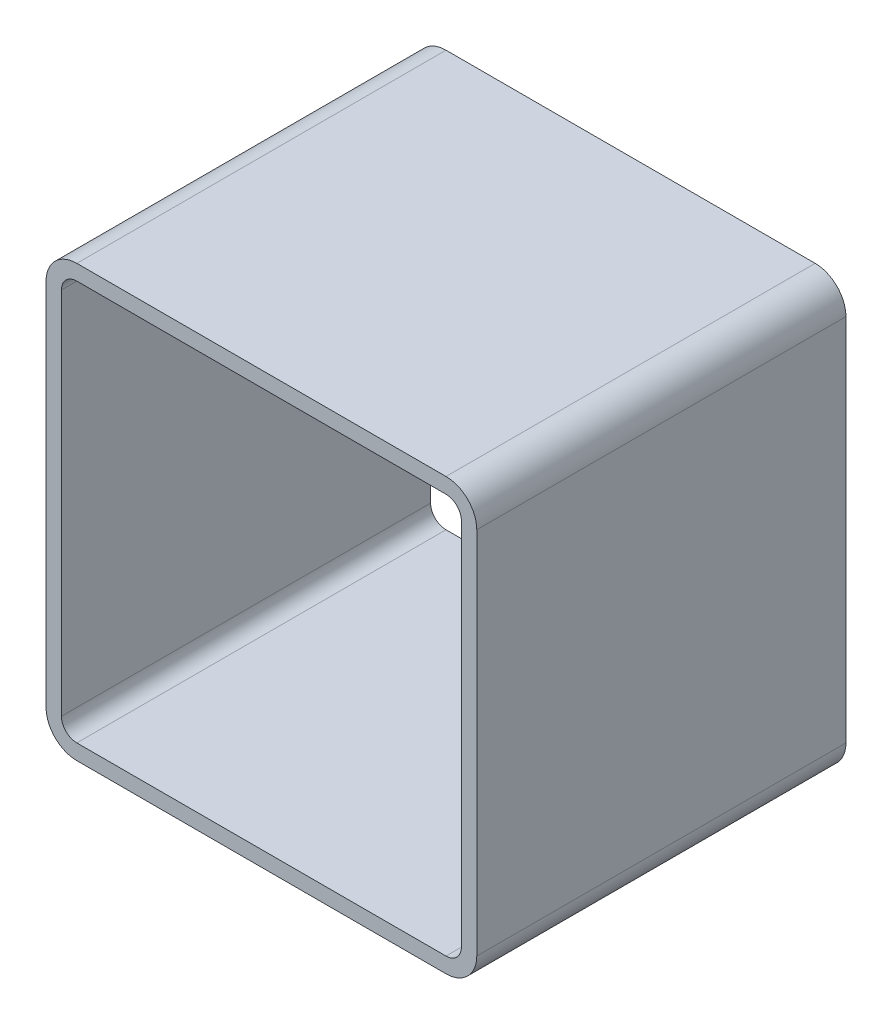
ISO-10303-21;
HEADER;
FILE_DESCRIPTION(('STEP AP214'),'2;1');
FILE_NAME('part.step','',(''),(''),'','','');
FILE_SCHEMA(('AUTOMOTIVE_DESIGN { 1 0 10303 214 1 1 1 1 }'));
ENDSEC;
DATA;
#1=APPLICATION_CONTEXT('core data for automotive mechanical design processes');
#2=APPLICATION_PROTOCOL_DEFINITION('international standard','automotive_design',2000,#1);
#3=PRODUCT_CONTEXT('',#1,'mechanical');
#4=PRODUCT('Part','Part','',(#3));
#5=PRODUCT_RELATED_PRODUCT_CATEGORY('part','',(#4));
#6=PRODUCT_DEFINITION_FORMATION('','',#4);
#7=PRODUCT_DEFINITION_CONTEXT('part definition',#1,'design');
#8=PRODUCT_DEFINITION('design','',#6,#7);
#9=PRODUCT_DEFINITION_SHAPE('','',#8);
#10=(LENGTH_UNIT() NAMED_UNIT(*) SI_UNIT(.MILLI.,.METRE.));
#11=(NAMED_UNIT(*) PLANE_ANGLE_UNIT() SI_UNIT($,.RADIAN.));
#12=(NAMED_UNIT(*) SI_UNIT($,.STERADIAN.) SOLID_ANGLE_UNIT());
#13=UNCERTAINTY_MEASURE_WITH_UNIT(LENGTH_MEASURE(1.E-05),#10,'distance_accuracy_value','');
#14=(GEOMETRIC_REPRESENTATION_CONTEXT(3) GLOBAL_UNCERTAINTY_ASSIGNED_CONTEXT((#13)) GLOBAL_UNIT_ASSIGNED_CONTEXT((#10,
#11,#12)) REPRESENTATION_CONTEXT('',''));
#15=CARTESIAN_POINT('',(0.,0.,0.));
#16=DIRECTION('',(0.,0.,1.));
#17=DIRECTION('',(1.,0.,0.));
#18=AXIS2_PLACEMENT_3D('',#15,#16,#17);
#19=CARTESIAN_POINT('',(27.8503420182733,332.028679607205,304.8));
#20=DIRECTION('',(0.,0.,1.));
#21=DIRECTION('',(1.,0.,0.));
#22=AXIS2_PLACEMENT_3D('',#19,#20,#21);
#23=PLANE('',#22);
#24=CARTESIAN_POINT('',(27.8503420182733,332.028679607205,304.8));
#25=DIRECTION('',(0.,0.,1.));
#26=DIRECTION('',(1.,0.,0.));
#27=AXIS2_PLACEMENT_3D('',#24,#25,#26);
#28=CIRCLE('',#27,25.4);
#29=CARTESIAN_POINT('',(27.8503420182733,357.428679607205,304.8));
#30=VERTEX_POINT('',#29);
#31=CARTESIAN_POINT('',(2.45034201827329,332.028679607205,304.8));
#32=VERTEX_POINT('',#31);
#33=EDGE_CURVE('E211',#30,#32,#28,.T.);
#34=ORIENTED_EDGE('',*,*,#33,.T.);
#35=DIRECTION('',(0.,-1.,0.));
#36=VECTOR('',#35,1.);
#37=CARTESIAN_POINT('',(2.45034201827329,27.2286796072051,304.8));
#38=LINE('',#37,#36);
#39=CARTESIAN_POINT('',(2.45034201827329,27.2286796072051,304.8));
#40=VERTEX_POINT('',#39);
#41=EDGE_CURVE('E214',#32,#40,#38,.T.);
#42=ORIENTED_EDGE('',*,*,#41,.T.);
#43=CARTESIAN_POINT('',(27.8503420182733,27.2286796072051,304.8));
#44=DIRECTION('',(0.,0.,1.));
#45=DIRECTION('',(1.,0.,0.));
#46=AXIS2_PLACEMENT_3D('',#43,#44,#45);
#47=CIRCLE('',#46,25.4);
#48=CARTESIAN_POINT('',(27.8503420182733,1.82867960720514,304.8));
#49=VERTEX_POINT('',#48);
#50=EDGE_CURVE('E217',#40,#49,#47,.T.);
#51=ORIENTED_EDGE('',*,*,#50,.T.);
#52=DIRECTION('',(1.,0.,0.));
#53=VECTOR('',#52,1.);
#54=CARTESIAN_POINT('',(332.650342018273,1.82867960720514,304.8));
#55=LINE('',#54,#53);
#56=CARTESIAN_POINT('',(332.650342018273,1.82867960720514,304.8));
#57=VERTEX_POINT('',#56);
#58=EDGE_CURVE('E219',#49,#57,#55,.T.);
#59=ORIENTED_EDGE('',*,*,#58,.T.);
#60=CARTESIAN_POINT('',(332.650342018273,27.2286796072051,304.8));
#61=DIRECTION('',(0.,0.,1.));
#62=DIRECTION('',(1.,0.,0.));
#63=AXIS2_PLACEMENT_3D('',#60,#61,#62);
#64=CIRCLE('',#63,25.4);
#65=CARTESIAN_POINT('',(358.050342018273,27.2286796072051,304.8));
#66=VERTEX_POINT('',#65);
#67=EDGE_CURVE('E221',#57,#66,#64,.T.);
#68=ORIENTED_EDGE('',*,*,#67,.T.);
#69=DIRECTION('',(0.,1.,0.));
#70=VECTOR('',#69,1.);
#71=CARTESIAN_POINT('',(358.050342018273,332.028679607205,304.8));
#72=LINE('',#71,#70);
#73=CARTESIAN_POINT('',(358.050342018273,332.028679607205,304.8));
#74=VERTEX_POINT('',#73);
#75=EDGE_CURVE('E223',#66,#74,#72,.T.);
#76=ORIENTED_EDGE('',*,*,#75,.T.);
#77=CARTESIAN_POINT('',(332.650342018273,332.028679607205,304.8));
#78=DIRECTION('',(0.,0.,1.));
#79=DIRECTION('',(1.,0.,0.));
#80=AXIS2_PLACEMENT_3D('',#77,#78,#79);
#81=CIRCLE('',#80,25.3999999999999);
#82=CARTESIAN_POINT('',(332.650342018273,357.428679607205,304.8));
#83=VERTEX_POINT('',#82);
#84=EDGE_CURVE('E225',#74,#83,#81,.T.);
#85=ORIENTED_EDGE('',*,*,#84,.T.);
#86=DIRECTION('',(-1.,0.,0.));
#87=VECTOR('',#86,1.);
#88=CARTESIAN_POINT('',(27.8503420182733,357.428679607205,304.8));
#89=LINE('',#88,#87);
#90=EDGE_CURVE('E227',#83,#30,#89,.T.);
#91=ORIENTED_EDGE('',*,*,#90,.T.);
#92=EDGE_LOOP('',(#34,#42,#51,#59,#68,#76,#85,#91));
#93=FACE_BOUND('',#92,.T.);
#94=DIRECTION('',(0.,-1.,0.));
#95=VECTOR('',#94,1.);
#96=CARTESIAN_POINT('',(15.1503420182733,27.2286796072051,304.8));
#97=LINE('',#96,#95);
#98=CARTESIAN_POINT('',(15.1503420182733,332.028679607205,304.8));
#99=VERTEX_POINT('',#98);
#100=CARTESIAN_POINT('',(15.1503420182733,27.2286796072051,304.8));
#101=VERTEX_POINT('',#100);
#102=EDGE_CURVE('E154',#99,#101,#97,.T.);
#103=ORIENTED_EDGE('',*,*,#102,.F.);
#104=CARTESIAN_POINT('',(27.8503420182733,332.028679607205,304.8));
#105=DIRECTION('',(0.,0.,1.));
#106=DIRECTION('',(1.,0.,0.));
#107=AXIS2_PLACEMENT_3D('',#104,#105,#106);
#108=CIRCLE('',#107,12.7);
#109=CARTESIAN_POINT('',(27.8503420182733,344.728679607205,304.8));
#110=VERTEX_POINT('',#109);
#111=EDGE_CURVE('E146',#110,#99,#108,.T.);
#112=ORIENTED_EDGE('',*,*,#111,.F.);
#113=DIRECTION('',(-1.,0.,0.));
#114=VECTOR('',#113,1.);
#115=CARTESIAN_POINT('',(27.8503420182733,344.728679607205,304.8));
#116=LINE('',#115,#114);
#117=CARTESIAN_POINT('',(332.650342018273,344.728679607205,304.8));
#118=VERTEX_POINT('',#117);
#119=EDGE_CURVE('E179',#118,#110,#116,.T.);
#120=ORIENTED_EDGE('',*,*,#119,.F.);
#121=CARTESIAN_POINT('',(332.650342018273,332.028679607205,304.8));
#122=DIRECTION('',(0.,0.,1.));
#123=DIRECTION('',(1.,0.,0.));
#124=AXIS2_PLACEMENT_3D('',#121,#122,#123);
#125=CIRCLE('',#124,12.6999999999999);
#126=CARTESIAN_POINT('',(345.350342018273,332.028679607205,304.8));
#127=VERTEX_POINT('',#126);
#128=EDGE_CURVE('E177',#127,#118,#125,.T.);
#129=ORIENTED_EDGE('',*,*,#128,.F.);
#130=DIRECTION('',(0.,1.,0.));
#131=VECTOR('',#130,1.);
#132=CARTESIAN_POINT('',(345.350342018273,332.028679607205,304.8));
#133=LINE('',#132,#131);
#134=CARTESIAN_POINT('',(345.350342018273,27.2286796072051,304.8));
#135=VERTEX_POINT('',#134);
#136=EDGE_CURVE('E175',#135,#127,#133,.T.);
#137=ORIENTED_EDGE('',*,*,#136,.F.);
#138=CARTESIAN_POINT('',(332.650342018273,27.2286796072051,304.8));
#139=DIRECTION('',(0.,0.,1.));
#140=DIRECTION('',(1.,0.,0.));
#141=AXIS2_PLACEMENT_3D('',#138,#139,#140);
#142=CIRCLE('',#141,12.7);
#143=CARTESIAN_POINT('',(332.650342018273,14.5286796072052,304.8));
#144=VERTEX_POINT('',#143);
#145=EDGE_CURVE('E173',#144,#135,#142,.T.);
#146=ORIENTED_EDGE('',*,*,#145,.F.);
#147=DIRECTION('',(1.,0.,0.));
#148=VECTOR('',#147,1.);
#149=CARTESIAN_POINT('',(332.650342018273,14.5286796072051,304.8));
#150=LINE('',#149,#148);
#151=CARTESIAN_POINT('',(27.8503420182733,14.5286796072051,304.8));
#152=VERTEX_POINT('',#151);
#153=EDGE_CURVE('E169',#152,#144,#150,.T.);
#154=ORIENTED_EDGE('',*,*,#153,.F.);
#155=CARTESIAN_POINT('',(27.8503420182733,27.2286796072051,304.8));
#156=DIRECTION('',(0.,0.,1.));
#157=DIRECTION('',(1.,0.,0.));
#158=AXIS2_PLACEMENT_3D('',#155,#156,#157);
#159=CIRCLE('',#158,12.7);
#160=EDGE_CURVE('E167',#101,#152,#159,.T.);
#161=ORIENTED_EDGE('',*,*,#160,.F.);
#162=EDGE_LOOP('',(#103,#112,#120,#129,#137,#146,#154,#161));
#163=FACE_BOUND('',#162,.T.);
#164=ADVANCED_FACE('F33',(#93,#163),#23,.T.);
#165=CARTESIAN_POINT('',(27.8503420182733,332.028679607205,0.));
#166=DIRECTION('',(0.,0.,1.));
#167=DIRECTION('',(1.,0.,0.));
#168=AXIS2_PLACEMENT_3D('',#165,#166,#167);
#169=PLANE('',#168);
#170=CARTESIAN_POINT('',(27.8503420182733,332.028679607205,0.));
#171=DIRECTION('',(0.,0.,1.));
#172=DIRECTION('',(1.,0.,0.));
#173=AXIS2_PLACEMENT_3D('',#170,#171,#172);
#174=CIRCLE('',#173,25.4);
#175=CARTESIAN_POINT('',(27.8503420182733,357.428679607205,0.));
#176=VERTEX_POINT('',#175);
#177=CARTESIAN_POINT('',(2.45034201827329,332.028679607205,0.));
#178=VERTEX_POINT('',#177);
#179=EDGE_CURVE('E162',#176,#178,#174,.T.);
#180=ORIENTED_EDGE('',*,*,#179,.F.);
#181=DIRECTION('',(-1.,0.,0.));
#182=VECTOR('',#181,1.);
#183=CARTESIAN_POINT('',(27.8503420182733,357.428679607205,0.));
#184=LINE('',#183,#182);
#185=CARTESIAN_POINT('',(332.650342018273,357.428679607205,0.));
#186=VERTEX_POINT('',#185);
#187=EDGE_CURVE('E215',#186,#176,#184,.T.);
#188=ORIENTED_EDGE('',*,*,#187,.F.);
#189=CARTESIAN_POINT('',(332.650342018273,332.028679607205,0.));
#190=DIRECTION('',(0.,0.,1.));
#191=DIRECTION('',(1.,0.,0.));
#192=AXIS2_PLACEMENT_3D('',#189,#190,#191);
#193=CIRCLE('',#192,25.3999999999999);
#194=CARTESIAN_POINT('',(358.050342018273,332.028679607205,0.));
#195=VERTEX_POINT('',#194);
#196=EDGE_CURVE('E242',#195,#186,#193,.T.);
#197=ORIENTED_EDGE('',*,*,#196,.F.);
#198=DIRECTION('',(0.,1.,0.));
#199=VECTOR('',#198,1.);
#200=CARTESIAN_POINT('',(358.050342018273,332.028679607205,0.));
#201=LINE('',#200,#199);
#202=CARTESIAN_POINT('',(358.050342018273,27.2286796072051,0.));
#203=VERTEX_POINT('',#202);
#204=EDGE_CURVE('E240',#203,#195,#201,.T.);
#205=ORIENTED_EDGE('',*,*,#204,.F.);
#206=CARTESIAN_POINT('',(332.650342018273,27.2286796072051,0.));
#207=DIRECTION('',(0.,0.,1.));
#208=DIRECTION('',(1.,0.,0.));
#209=AXIS2_PLACEMENT_3D('',#206,#207,#208);
#210=CIRCLE('',#209,25.4);
#211=CARTESIAN_POINT('',(332.650342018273,1.82867960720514,0.));
#212=VERTEX_POINT('',#211);
#213=EDGE_CURVE('E238',#212,#203,#210,.T.);
#214=ORIENTED_EDGE('',*,*,#213,.F.);
#215=DIRECTION('',(1.,0.,0.));
#216=VECTOR('',#215,1.);
#217=CARTESIAN_POINT('',(332.650342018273,1.82867960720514,0.));
#218=LINE('',#217,#216);
#219=CARTESIAN_POINT('',(27.8503420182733,1.82867960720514,0.));
#220=VERTEX_POINT('',#219);
#221=EDGE_CURVE('E236',#220,#212,#218,.T.);
#222=ORIENTED_EDGE('',*,*,#221,.F.);
#223=CARTESIAN_POINT('',(27.8503420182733,27.2286796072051,0.));
#224=DIRECTION('',(0.,0.,1.));
#225=DIRECTION('',(1.,0.,0.));
#226=AXIS2_PLACEMENT_3D('',#223,#224,#225);
#227=CIRCLE('',#226,25.4);
#228=CARTESIAN_POINT('',(2.45034201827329,27.2286796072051,0.));
#229=VERTEX_POINT('',#228);
#230=EDGE_CURVE('E234',#229,#220,#227,.T.);
#231=ORIENTED_EDGE('',*,*,#230,.F.);
#232=DIRECTION('',(0.,-1.,0.));
#233=VECTOR('',#232,1.);
#234=CARTESIAN_POINT('',(2.45034201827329,27.2286796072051,0.));
#235=LINE('',#234,#233);
#236=EDGE_CURVE('E232',#178,#229,#235,.T.);
#237=ORIENTED_EDGE('',*,*,#236,.F.);
#238=EDGE_LOOP('',(#180,#188,#197,#205,#214,#222,#231,#237));
#239=FACE_BOUND('',#238,.T.);
#240=CARTESIAN_POINT('',(27.8503420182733,332.028679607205,0.));
#241=DIRECTION('',(0.,0.,1.));
#242=DIRECTION('',(1.,0.,0.));
#243=AXIS2_PLACEMENT_3D('',#240,#241,#242);
#244=CIRCLE('',#243,12.7);
#245=CARTESIAN_POINT('',(27.8503420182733,344.728679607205,0.));
#246=VERTEX_POINT('',#245);
#247=CARTESIAN_POINT('',(15.1503420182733,332.028679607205,0.));
#248=VERTEX_POINT('',#247);
#249=EDGE_CURVE('E56',#246,#248,#244,.T.);
#250=ORIENTED_EDGE('',*,*,#249,.T.);
#251=DIRECTION('',(0.,-1.,0.));
#252=VECTOR('',#251,1.);
#253=CARTESIAN_POINT('',(15.1503420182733,27.2286796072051,0.));
#254=LINE('',#253,#252);
#255=CARTESIAN_POINT('',(15.1503420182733,27.2286796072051,0.));
#256=VERTEX_POINT('',#255);
#257=EDGE_CURVE('E161',#248,#256,#254,.T.);
#258=ORIENTED_EDGE('',*,*,#257,.T.);
#259=CARTESIAN_POINT('',(27.8503420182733,27.2286796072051,0.));
#260=DIRECTION('',(0.,0.,1.));
#261=DIRECTION('',(1.,0.,0.));
#262=AXIS2_PLACEMENT_3D('',#259,#260,#261);
#263=CIRCLE('',#262,12.7);
#264=CARTESIAN_POINT('',(27.8503420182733,14.5286796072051,0.));
#265=VERTEX_POINT('',#264);
#266=EDGE_CURVE('E183',#256,#265,#263,.T.);
#267=ORIENTED_EDGE('',*,*,#266,.T.);
#268=DIRECTION('',(1.,0.,0.));
#269=VECTOR('',#268,1.);
#270=CARTESIAN_POINT('',(332.650342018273,14.5286796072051,0.));
#271=LINE('',#270,#269);
#272=CARTESIAN_POINT('',(332.650342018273,14.5286796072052,0.));
#273=VERTEX_POINT('',#272);
#274=EDGE_CURVE('E186',#265,#273,#271,.T.);
#275=ORIENTED_EDGE('',*,*,#274,.T.);
#276=CARTESIAN_POINT('',(332.650342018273,27.2286796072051,0.));
#277=DIRECTION('',(0.,0.,1.));
#278=DIRECTION('',(1.,0.,0.));
#279=AXIS2_PLACEMENT_3D('',#276,#277,#278);
#280=CIRCLE('',#279,12.7);
#281=CARTESIAN_POINT('',(345.350342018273,27.2286796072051,0.));
#282=VERTEX_POINT('',#281);
#283=EDGE_CURVE('E189',#273,#282,#280,.T.);
#284=ORIENTED_EDGE('',*,*,#283,.T.);
#285=DIRECTION('',(0.,1.,0.));
#286=VECTOR('',#285,1.);
#287=CARTESIAN_POINT('',(345.350342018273,332.028679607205,0.));
#288=LINE('',#287,#286);
#289=CARTESIAN_POINT('',(345.350342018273,332.028679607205,0.));
#290=VERTEX_POINT('',#289);
#291=EDGE_CURVE('E192',#282,#290,#288,.T.);
#292=ORIENTED_EDGE('',*,*,#291,.T.);
#293=CARTESIAN_POINT('',(332.650342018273,332.028679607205,0.));
#294=DIRECTION('',(0.,0.,1.));
#295=DIRECTION('',(1.,0.,0.));
#296=AXIS2_PLACEMENT_3D('',#293,#294,#295);
#297=CIRCLE('',#296,12.6999999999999);
#298=CARTESIAN_POINT('',(332.650342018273,344.728679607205,0.));
#299=VERTEX_POINT('',#298);
#300=EDGE_CURVE('E195',#290,#299,#297,.T.);
#301=ORIENTED_EDGE('',*,*,#300,.T.);
#302=DIRECTION('',(-1.,0.,0.));
#303=VECTOR('',#302,1.);
#304=CARTESIAN_POINT('',(27.8503420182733,344.728679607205,0.));
#305=LINE('',#304,#303);
#306=EDGE_CURVE('E155',#299,#246,#305,.T.);
#307=ORIENTED_EDGE('',*,*,#306,.T.);
#308=EDGE_LOOP('',(#250,#258,#267,#275,#284,#292,#301,#307));
#309=FACE_BOUND('',#308,.T.);
#310=ADVANCED_FACE('F272',(#239,#309),#169,.F.);
#311=CARTESIAN_POINT('',(27.8503420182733,332.028679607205,304.8));
#312=DIRECTION('',(0.,0.,-1.));
#313=DIRECTION('',(-1.,0.,0.));
#314=AXIS2_PLACEMENT_3D('',#311,#312,#313);
#315=CYLINDRICAL_SURFACE('',#314,25.4);
#316=ORIENTED_EDGE('',*,*,#179,.T.);
#317=DIRECTION('',(0.,0.,-1.));
#318=VECTOR('',#317,1.);
#319=CARTESIAN_POINT('',(2.45034201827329,332.028679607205,304.8));
#320=LINE('',#319,#318);
#321=EDGE_CURVE('E11',#32,#178,#320,.T.);
#322=ORIENTED_EDGE('',*,*,#321,.F.);
#323=ORIENTED_EDGE('',*,*,#33,.F.);
#324=DIRECTION('',(0.,0.,-1.));
#325=VECTOR('',#324,1.);
#326=CARTESIAN_POINT('',(27.8503420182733,357.428679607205,304.8));
#327=LINE('',#326,#325);
#328=EDGE_CURVE('E229',#30,#176,#327,.T.);
#329=ORIENTED_EDGE('',*,*,#328,.T.);
#330=EDGE_LOOP('',(#316,#322,#323,#329));
#331=FACE_BOUND('',#330,.T.);
#332=ADVANCED_FACE('F35',(#331),#315,.T.);
#333=CARTESIAN_POINT('',(2.45034201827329,27.2286796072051,304.8));
#334=DIRECTION('',(1.,0.,0.));
#335=DIRECTION('',(0.,0.,-1.));
#336=AXIS2_PLACEMENT_3D('',#333,#334,#335);
#337=PLANE('',#336);
#338=ORIENTED_EDGE('',*,*,#236,.T.);
#339=DIRECTION('',(0.,0.,-1.));
#340=VECTOR('',#339,1.);
#341=CARTESIAN_POINT('',(2.45034201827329,27.2286796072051,304.8));
#342=LINE('',#341,#340);
#343=EDGE_CURVE('E41',#40,#229,#342,.T.);
#344=ORIENTED_EDGE('',*,*,#343,.F.);
#345=ORIENTED_EDGE('',*,*,#41,.F.);
#346=ORIENTED_EDGE('',*,*,#321,.T.);
#347=EDGE_LOOP('',(#338,#344,#345,#346));
#348=FACE_BOUND('',#347,.T.);
#349=ADVANCED_FACE('F289',(#348),#337,.F.);
#350=CARTESIAN_POINT('',(27.8503420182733,27.2286796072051,304.8));
#351=DIRECTION('',(0.,0.,-1.));
#352=DIRECTION('',(-1.,0.,0.));
#353=AXIS2_PLACEMENT_3D('',#350,#351,#352);
#354=CYLINDRICAL_SURFACE('',#353,25.4);
#355=ORIENTED_EDGE('',*,*,#230,.T.);
#356=DIRECTION('',(0.,0.,-1.));
#357=VECTOR('',#356,1.);
#358=CARTESIAN_POINT('',(27.8503420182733,1.82867960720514,304.8));
#359=LINE('',#358,#357);
#360=EDGE_CURVE('E259',#49,#220,#359,.T.);
#361=ORIENTED_EDGE('',*,*,#360,.F.);
#362=ORIENTED_EDGE('',*,*,#50,.F.);
#363=ORIENTED_EDGE('',*,*,#343,.T.);
#364=EDGE_LOOP('',(#355,#361,#362,#363));
#365=FACE_BOUND('',#364,.T.);
#366=ADVANCED_FACE('F266',(#365),#354,.T.);
#367=CARTESIAN_POINT('',(332.650342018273,1.82867960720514,304.8));
#368=DIRECTION('',(0.,1.,0.));
#369=DIRECTION('',(0.,0.,1.));
#370=AXIS2_PLACEMENT_3D('',#367,#368,#369);
#371=PLANE('',#370);
#372=ORIENTED_EDGE('',*,*,#221,.T.);
#373=DIRECTION('',(0.,0.,-1.));
#374=VECTOR('',#373,1.);
#375=CARTESIAN_POINT('',(332.650342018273,1.82867960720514,304.8));
#376=LINE('',#375,#374);
#377=EDGE_CURVE('E256',#57,#212,#376,.T.);
#378=ORIENTED_EDGE('',*,*,#377,.F.);
#379=ORIENTED_EDGE('',*,*,#58,.F.);
#380=ORIENTED_EDGE('',*,*,#360,.T.);
#381=EDGE_LOOP('',(#372,#378,#379,#380));
#382=FACE_BOUND('',#381,.T.);
#383=ADVANCED_FACE('F278',(#382),#371,.F.);
#384=CARTESIAN_POINT('',(332.650342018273,27.2286796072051,304.8));
#385=DIRECTION('',(0.,0.,-1.));
#386=DIRECTION('',(-1.,0.,0.));
#387=AXIS2_PLACEMENT_3D('',#384,#385,#386);
#388=CYLINDRICAL_SURFACE('',#387,25.4);
#389=ORIENTED_EDGE('',*,*,#213,.T.);
#390=DIRECTION('',(0.,0.,-1.));
#391=VECTOR('',#390,1.);
#392=CARTESIAN_POINT('',(358.050342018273,27.2286796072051,304.8));
#393=LINE('',#392,#391);
#394=EDGE_CURVE('E253',#66,#203,#393,.T.);
#395=ORIENTED_EDGE('',*,*,#394,.F.);
#396=ORIENTED_EDGE('',*,*,#67,.F.);
#397=ORIENTED_EDGE('',*,*,#377,.T.);
#398=EDGE_LOOP('',(#389,#395,#396,#397));
#399=FACE_BOUND('',#398,.T.);
#400=ADVANCED_FACE('F282',(#399),#388,.T.);
#401=CARTESIAN_POINT('',(358.050342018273,332.028679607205,304.8));
#402=DIRECTION('',(-1.,0.,0.));
#403=DIRECTION('',(0.,0.,1.));
#404=AXIS2_PLACEMENT_3D('',#401,#402,#403);
#405=PLANE('',#404);
#406=ORIENTED_EDGE('',*,*,#204,.T.);
#407=DIRECTION('',(0.,0.,-1.));
#408=VECTOR('',#407,1.);
#409=CARTESIAN_POINT('',(358.050342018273,332.028679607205,304.8));
#410=LINE('',#409,#408);
#411=EDGE_CURVE('E250',#74,#195,#410,.T.);
#412=ORIENTED_EDGE('',*,*,#411,.F.);
#413=ORIENTED_EDGE('',*,*,#75,.F.);
#414=ORIENTED_EDGE('',*,*,#394,.T.);
#415=EDGE_LOOP('',(#406,#412,#413,#414));
#416=FACE_BOUND('',#415,.T.);
#417=ADVANCED_FACE('F302',(#416),#405,.F.);
#418=CARTESIAN_POINT('',(332.650342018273,332.028679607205,304.8));
#419=DIRECTION('',(0.,0.,-1.));
#420=DIRECTION('',(-1.,0.,0.));
#421=AXIS2_PLACEMENT_3D('',#418,#419,#420);
#422=CYLINDRICAL_SURFACE('',#421,25.3999999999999);
#423=ORIENTED_EDGE('',*,*,#196,.T.);
#424=DIRECTION('',(0.,0.,-1.));
#425=VECTOR('',#424,1.);
#426=CARTESIAN_POINT('',(332.650342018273,357.428679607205,304.8));
#427=LINE('',#426,#425);
#428=EDGE_CURVE('E247',#83,#186,#427,.T.);
#429=ORIENTED_EDGE('',*,*,#428,.F.);
#430=ORIENTED_EDGE('',*,*,#84,.F.);
#431=ORIENTED_EDGE('',*,*,#411,.T.);
#432=EDGE_LOOP('',(#423,#429,#430,#431));
#433=FACE_BOUND('',#432,.T.);
#434=ADVANCED_FACE('F300',(#433),#422,.T.);
#435=CARTESIAN_POINT('',(27.8503420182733,357.428679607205,304.8));
#436=DIRECTION('',(0.,-1.,0.));
#437=DIRECTION('',(0.,0.,-1.));
#438=AXIS2_PLACEMENT_3D('',#435,#436,#437);
#439=PLANE('',#438);
#440=ORIENTED_EDGE('',*,*,#187,.T.);
#441=ORIENTED_EDGE('',*,*,#328,.F.);
#442=ORIENTED_EDGE('',*,*,#90,.F.);
#443=ORIENTED_EDGE('',*,*,#428,.T.);
#444=EDGE_LOOP('',(#440,#441,#442,#443));
#445=FACE_BOUND('',#444,.T.);
#446=ADVANCED_FACE('F295',(#445),#439,.F.);
#447=CARTESIAN_POINT('',(27.8503420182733,332.028679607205,304.8));
#448=DIRECTION('',(0.,0.,-1.));
#449=DIRECTION('',(-1.,0.,0.));
#450=AXIS2_PLACEMENT_3D('',#447,#448,#449);
#451=CYLINDRICAL_SURFACE('',#450,12.7);
#452=ORIENTED_EDGE('',*,*,#249,.F.);
#453=DIRECTION('',(0.,0.,-1.));
#454=VECTOR('',#453,1.);
#455=CARTESIAN_POINT('',(27.8503420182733,344.728679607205,304.8));
#456=LINE('',#455,#454);
#457=EDGE_CURVE('E150',#110,#246,#456,.T.);
#458=ORIENTED_EDGE('',*,*,#457,.F.);
#459=ORIENTED_EDGE('',*,*,#111,.T.);
#460=DIRECTION('',(0.,0.,-1.));
#461=VECTOR('',#460,1.);
#462=CARTESIAN_POINT('',(15.1503420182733,332.028679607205,304.8));
#463=LINE('',#462,#461);
#464=EDGE_CURVE('E149',#99,#248,#463,.T.);
#465=ORIENTED_EDGE('',*,*,#464,.T.);
#466=EDGE_LOOP('',(#452,#458,#459,#465));
#467=FACE_BOUND('',#466,.T.);
#468=ADVANCED_FACE('F148',(#467),#451,.F.);
#469=CARTESIAN_POINT('',(15.1503420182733,27.2286796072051,304.8));
#470=DIRECTION('',(1.,0.,0.));
#471=DIRECTION('',(0.,0.,-1.));
#472=AXIS2_PLACEMENT_3D('',#469,#470,#471);
#473=PLANE('',#472);
#474=ORIENTED_EDGE('',*,*,#257,.F.);
#475=ORIENTED_EDGE('',*,*,#464,.F.);
#476=ORIENTED_EDGE('',*,*,#102,.T.);
#477=DIRECTION('',(0.,0.,-1.));
#478=VECTOR('',#477,1.);
#479=CARTESIAN_POINT('',(15.1503420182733,27.2286796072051,304.8));
#480=LINE('',#479,#478);
#481=EDGE_CURVE('E163',#101,#256,#480,.T.);
#482=ORIENTED_EDGE('',*,*,#481,.T.);
#483=EDGE_LOOP('',(#474,#475,#476,#482));
#484=FACE_BOUND('',#483,.T.);
#485=ADVANCED_FACE('F158',(#484),#473,.T.);
#486=CARTESIAN_POINT('',(27.8503420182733,27.2286796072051,304.8));
#487=DIRECTION('',(0.,0.,-1.));
#488=DIRECTION('',(-1.,0.,0.));
#489=AXIS2_PLACEMENT_3D('',#486,#487,#488);
#490=CYLINDRICAL_SURFACE('',#489,12.7);
#491=ORIENTED_EDGE('',*,*,#266,.F.);
#492=ORIENTED_EDGE('',*,*,#481,.F.);
#493=ORIENTED_EDGE('',*,*,#160,.T.);
#494=DIRECTION('',(0.,0.,-1.));
#495=VECTOR('',#494,1.);
#496=CARTESIAN_POINT('',(27.8503420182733,14.5286796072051,304.8));
#497=LINE('',#496,#495);
#498=EDGE_CURVE('E208',#152,#265,#497,.T.);
#499=ORIENTED_EDGE('',*,*,#498,.T.);
#500=EDGE_LOOP('',(#491,#492,#493,#499));
#501=FACE_BOUND('',#500,.T.);
#502=ADVANCED_FACE('F327',(#501),#490,.F.);
#503=CARTESIAN_POINT('',(332.650342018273,14.5286796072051,304.8));
#504=DIRECTION('',(0.,1.,0.));
#505=DIRECTION('',(0.,0.,1.));
#506=AXIS2_PLACEMENT_3D('',#503,#504,#505);
#507=PLANE('',#506);
#508=ORIENTED_EDGE('',*,*,#274,.F.);
#509=ORIENTED_EDGE('',*,*,#498,.F.);
#510=ORIENTED_EDGE('',*,*,#153,.T.);
#511=DIRECTION('',(0.,0.,-1.));
#512=VECTOR('',#511,1.);
#513=CARTESIAN_POINT('',(332.650342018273,14.5286796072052,304.8));
#514=LINE('',#513,#512);
#515=EDGE_CURVE('E206',#144,#273,#514,.T.);
#516=ORIENTED_EDGE('',*,*,#515,.T.);
#517=EDGE_LOOP('',(#508,#509,#510,#516));
#518=FACE_BOUND('',#517,.T.);
#519=ADVANCED_FACE('F331',(#518),#507,.T.);
#520=CARTESIAN_POINT('',(332.650342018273,27.2286796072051,304.8));
#521=DIRECTION('',(0.,0.,-1.));
#522=DIRECTION('',(-1.,0.,0.));
#523=AXIS2_PLACEMENT_3D('',#520,#521,#522);
#524=CYLINDRICAL_SURFACE('',#523,12.7);
#525=ORIENTED_EDGE('',*,*,#283,.F.);
#526=ORIENTED_EDGE('',*,*,#515,.F.);
#527=ORIENTED_EDGE('',*,*,#145,.T.);
#528=DIRECTION('',(0.,0.,-1.));
#529=VECTOR('',#528,1.);
#530=CARTESIAN_POINT('',(345.350342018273,27.2286796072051,304.8));
#531=LINE('',#530,#529);
#532=EDGE_CURVE('E204',#135,#282,#531,.T.);
#533=ORIENTED_EDGE('',*,*,#532,.T.);
#534=EDGE_LOOP('',(#525,#526,#527,#533));
#535=FACE_BOUND('',#534,.T.);
#536=ADVANCED_FACE('F337',(#535),#524,.F.);
#537=CARTESIAN_POINT('',(345.350342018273,332.028679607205,304.8));
#538=DIRECTION('',(-1.,0.,0.));
#539=DIRECTION('',(0.,0.,1.));
#540=AXIS2_PLACEMENT_3D('',#537,#538,#539);
#541=PLANE('',#540);
#542=ORIENTED_EDGE('',*,*,#291,.F.);
#543=ORIENTED_EDGE('',*,*,#532,.F.);
#544=ORIENTED_EDGE('',*,*,#136,.T.);
#545=DIRECTION('',(0.,0.,-1.));
#546=VECTOR('',#545,1.);
#547=CARTESIAN_POINT('',(345.350342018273,332.028679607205,304.8));
#548=LINE('',#547,#546);
#549=EDGE_CURVE('E202',#127,#290,#548,.T.);
#550=ORIENTED_EDGE('',*,*,#549,.T.);
#551=EDGE_LOOP('',(#542,#543,#544,#550));
#552=FACE_BOUND('',#551,.T.);
#553=ADVANCED_FACE('F341',(#552),#541,.T.);
#554=CARTESIAN_POINT('',(332.650342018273,332.028679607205,304.8));
#555=DIRECTION('',(0.,0.,-1.));
#556=DIRECTION('',(-1.,0.,0.));
#557=AXIS2_PLACEMENT_3D('',#554,#555,#556);
#558=CYLINDRICAL_SURFACE('',#557,12.6999999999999);
#559=ORIENTED_EDGE('',*,*,#300,.F.);
#560=ORIENTED_EDGE('',*,*,#549,.F.);
#561=ORIENTED_EDGE('',*,*,#128,.T.);
#562=DIRECTION('',(0.,0.,-1.));
#563=VECTOR('',#562,1.);
#564=CARTESIAN_POINT('',(332.650342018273,344.728679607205,304.8));
#565=LINE('',#564,#563);
#566=EDGE_CURVE('E48',#118,#299,#565,.T.);
#567=ORIENTED_EDGE('',*,*,#566,.T.);
#568=EDGE_LOOP('',(#559,#560,#561,#567));
#569=FACE_BOUND('',#568,.T.);
#570=ADVANCED_FACE('F345',(#569),#558,.F.);
#571=CARTESIAN_POINT('',(27.8503420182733,344.728679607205,304.8));
#572=DIRECTION('',(0.,-1.,0.));
#573=DIRECTION('',(0.,0.,-1.));
#574=AXIS2_PLACEMENT_3D('',#571,#572,#573);
#575=PLANE('',#574);
#576=ORIENTED_EDGE('',*,*,#306,.F.);
#577=ORIENTED_EDGE('',*,*,#566,.F.);
#578=ORIENTED_EDGE('',*,*,#119,.T.);
#579=ORIENTED_EDGE('',*,*,#457,.T.);
#580=EDGE_LOOP('',(#576,#577,#578,#579));
#581=FACE_BOUND('',#580,.T.);
#582=ADVANCED_FACE('F349',(#581),#575,.T.);
#583=CLOSED_SHELL('',(#164,#310,#332,#349,#366,#383,#400,#417,#434,#446,#468,#485,#502,#519,
#536,#553,#570,#582));
#584=MANIFOLD_SOLID_BREP('B2',#583);
#585=ADVANCED_BREP_SHAPE_REPRESENTATION('',(#18,#584),#14);
#586=SHAPE_DEFINITION_REPRESENTATION(#9,#585);
ENDSEC;
END-ISO-10303-21;
